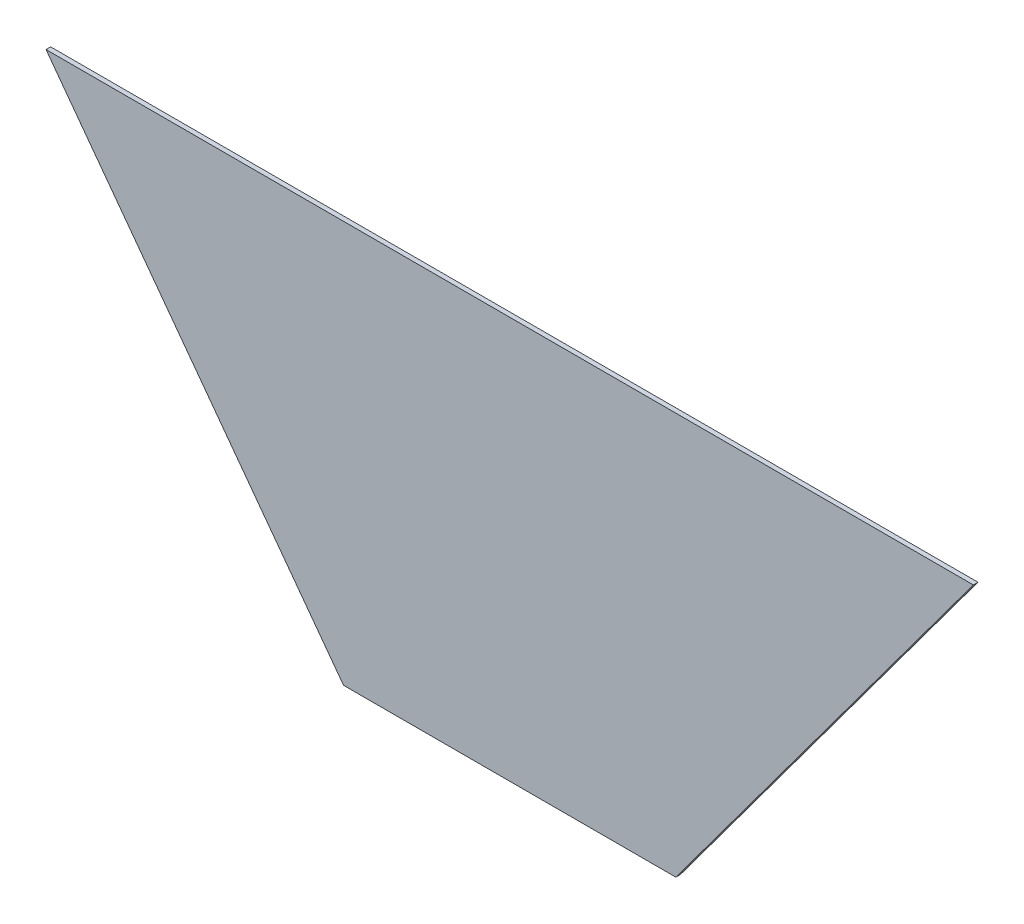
ISO-10303-21;
HEADER;
FILE_DESCRIPTION(('STEP AP214'),'2;1');
FILE_NAME('part.step','',(''),(''),'','','');
FILE_SCHEMA(('AUTOMOTIVE_DESIGN { 1 0 10303 214 1 1 1 1 }'));
ENDSEC;
DATA;
#1=APPLICATION_CONTEXT('core data for automotive mechanical design processes');
#2=APPLICATION_PROTOCOL_DEFINITION('international standard','automotive_design',2000,#1);
#3=PRODUCT_CONTEXT('',#1,'mechanical');
#4=PRODUCT('Part','Part','',(#3));
#5=PRODUCT_RELATED_PRODUCT_CATEGORY('part','',(#4));
#6=PRODUCT_DEFINITION_FORMATION('','',#4);
#7=PRODUCT_DEFINITION_CONTEXT('part definition',#1,'design');
#8=PRODUCT_DEFINITION('design','',#6,#7);
#9=PRODUCT_DEFINITION_SHAPE('','',#8);
#10=(LENGTH_UNIT() NAMED_UNIT(*) SI_UNIT(.MILLI.,.METRE.));
#11=(NAMED_UNIT(*) PLANE_ANGLE_UNIT() SI_UNIT($,.RADIAN.));
#12=(NAMED_UNIT(*) SI_UNIT($,.STERADIAN.) SOLID_ANGLE_UNIT());
#13=UNCERTAINTY_MEASURE_WITH_UNIT(LENGTH_MEASURE(1.E-05),#10,'distance_accuracy_value','');
#14=(GEOMETRIC_REPRESENTATION_CONTEXT(3) GLOBAL_UNCERTAINTY_ASSIGNED_CONTEXT((#13)) GLOBAL_UNIT_ASSIGNED_CONTEXT((#10,
#11,#12)) REPRESENTATION_CONTEXT('',''));
#15=CARTESIAN_POINT('',(0.,0.,0.));
#16=DIRECTION('',(0.,0.,1.));
#17=DIRECTION('',(1.,0.,0.));
#18=AXIS2_PLACEMENT_3D('',#15,#16,#17);
#19=CARTESIAN_POINT('',(-300.,260.,3.));
#20=DIRECTION('',(0.803694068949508,0.595042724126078,0.));
#21=DIRECTION('',(-0.595042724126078,0.803694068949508,0.));
#22=AXIS2_PLACEMENT_3D('',#19,#20,#21);
#23=PLANE('',#22);
#24=DIRECTION('',(0.595042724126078,-0.803694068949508,0.));
#25=VECTOR('',#24,1.);
#26=CARTESIAN_POINT('',(-300.,260.,0.));
#27=LINE('',#26,#25);
#28=CARTESIAN_POINT('',(-300.,260.,0.));
#29=VERTEX_POINT('',#28);
#30=CARTESIAN_POINT('',(-107.5,0.,0.));
#31=VERTEX_POINT('',#30);
#32=EDGE_CURVE('E98',#29,#31,#27,.T.);
#33=ORIENTED_EDGE('',*,*,#32,.T.);
#34=DIRECTION('',(0.,0.,-1.));
#35=VECTOR('',#34,1.);
#36=CARTESIAN_POINT('',(-107.5,0.,3.));
#37=LINE('',#36,#35);
#38=CARTESIAN_POINT('',(-107.5,0.,3.));
#39=VERTEX_POINT('',#38);
#40=EDGE_CURVE('E11',#39,#31,#37,.T.);
#41=ORIENTED_EDGE('',*,*,#40,.F.);
#42=DIRECTION('',(0.595042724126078,-0.803694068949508,0.));
#43=VECTOR('',#42,1.);
#44=CARTESIAN_POINT('',(-300.,260.,3.));
#45=LINE('',#44,#43);
#46=CARTESIAN_POINT('',(-300.,260.,3.));
#47=VERTEX_POINT('',#46);
#48=EDGE_CURVE('E86',#47,#39,#45,.T.);
#49=ORIENTED_EDGE('',*,*,#48,.F.);
#50=DIRECTION('',(0.,0.,-1.));
#51=VECTOR('',#50,1.);
#52=CARTESIAN_POINT('',(-300.,260.,3.));
#53=LINE('',#52,#51);
#54=EDGE_CURVE('E94',#47,#29,#53,.T.);
#55=ORIENTED_EDGE('',*,*,#54,.T.);
#56=EDGE_LOOP('',(#33,#41,#49,#55));
#57=FACE_BOUND('',#56,.T.);
#58=ADVANCED_FACE('F35',(#57),#23,.F.);
#59=CARTESIAN_POINT('',(-107.5,0.,3.));
#60=DIRECTION('',(0.,1.,0.));
#61=DIRECTION('',(0.,0.,1.));
#62=AXIS2_PLACEMENT_3D('',#59,#60,#61);
#63=PLANE('',#62);
#64=DIRECTION('',(1.,0.,0.));
#65=VECTOR('',#64,1.);
#66=CARTESIAN_POINT('',(-107.5,0.,0.));
#67=LINE('',#66,#65);
#68=CARTESIAN_POINT('',(107.5,0.,0.));
#69=VERTEX_POINT('',#68);
#70=EDGE_CURVE('E90',#31,#69,#67,.T.);
#71=ORIENTED_EDGE('',*,*,#70,.T.);
#72=DIRECTION('',(0.,0.,-1.));
#73=VECTOR('',#72,1.);
#74=CARTESIAN_POINT('',(107.5,0.,3.));
#75=LINE('',#74,#73);
#76=CARTESIAN_POINT('',(107.5,0.,3.));
#77=VERTEX_POINT('',#76);
#78=EDGE_CURVE('E43',#77,#69,#75,.T.);
#79=ORIENTED_EDGE('',*,*,#78,.F.);
#80=DIRECTION('',(1.,0.,0.));
#81=VECTOR('',#80,1.);
#82=CARTESIAN_POINT('',(-107.5,0.,3.));
#83=LINE('',#82,#81);
#84=EDGE_CURVE('E81',#39,#77,#83,.T.);
#85=ORIENTED_EDGE('',*,*,#84,.F.);
#86=ORIENTED_EDGE('',*,*,#40,.T.);
#87=EDGE_LOOP('',(#71,#79,#85,#86));
#88=FACE_BOUND('',#87,.T.);
#89=ADVANCED_FACE('F89',(#88),#63,.F.);
#90=CARTESIAN_POINT('',(300.,260.,3.));
#91=DIRECTION('',(-0.803694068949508,0.595042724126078,0.));
#92=DIRECTION('',(-0.595042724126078,-0.803694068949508,0.));
#93=AXIS2_PLACEMENT_3D('',#90,#91,#92);
#94=PLANE('',#93);
#95=DIRECTION('',(0.595042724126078,0.803694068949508,0.));
#96=VECTOR('',#95,1.);
#97=CARTESIAN_POINT('',(300.,260.,0.));
#98=LINE('',#97,#96);
#99=CARTESIAN_POINT('',(300.,260.,0.));
#100=VERTEX_POINT('',#99);
#101=EDGE_CURVE('E68',#69,#100,#98,.T.);
#102=ORIENTED_EDGE('',*,*,#101,.T.);
#103=DIRECTION('',(0.,0.,-1.));
#104=VECTOR('',#103,1.);
#105=CARTESIAN_POINT('',(300.,260.,3.));
#106=LINE('',#105,#104);
#107=CARTESIAN_POINT('',(300.,260.,3.));
#108=VERTEX_POINT('',#107);
#109=EDGE_CURVE('E91',#108,#100,#106,.T.);
#110=ORIENTED_EDGE('',*,*,#109,.F.);
#111=DIRECTION('',(0.595042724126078,0.803694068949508,0.));
#112=VECTOR('',#111,1.);
#113=CARTESIAN_POINT('',(300.,260.,3.));
#114=LINE('',#113,#112);
#115=EDGE_CURVE('E84',#77,#108,#114,.T.);
#116=ORIENTED_EDGE('',*,*,#115,.F.);
#117=ORIENTED_EDGE('',*,*,#78,.T.);
#118=EDGE_LOOP('',(#102,#110,#116,#117));
#119=FACE_BOUND('',#118,.T.);
#120=ADVANCED_FACE('F92',(#119),#94,.F.);
#121=CARTESIAN_POINT('',(-300.,260.,3.));
#122=DIRECTION('',(0.,-1.,0.));
#123=DIRECTION('',(0.,0.,-1.));
#124=AXIS2_PLACEMENT_3D('',#121,#122,#123);
#125=PLANE('',#124);
#126=DIRECTION('',(-1.,0.,0.));
#127=VECTOR('',#126,1.);
#128=CARTESIAN_POINT('',(-300.,260.,0.));
#129=LINE('',#128,#127);
#130=EDGE_CURVE('E74',#100,#29,#129,.T.);
#131=ORIENTED_EDGE('',*,*,#130,.T.);
#132=ORIENTED_EDGE('',*,*,#54,.F.);
#133=DIRECTION('',(-1.,0.,0.));
#134=VECTOR('',#133,1.);
#135=CARTESIAN_POINT('',(-300.,260.,3.));
#136=LINE('',#135,#134);
#137=EDGE_CURVE('E51',#108,#47,#136,.T.);
#138=ORIENTED_EDGE('',*,*,#137,.F.);
#139=ORIENTED_EDGE('',*,*,#109,.T.);
#140=EDGE_LOOP('',(#131,#132,#138,#139));
#141=FACE_BOUND('',#140,.T.);
#142=ADVANCED_FACE('F105',(#141),#125,.F.);
#143=CARTESIAN_POINT('',(0.,0.,3.));
#144=DIRECTION('',(0.,0.,-1.));
#145=DIRECTION('',(-1.,0.,0.));
#146=AXIS2_PLACEMENT_3D('',#143,#144,#145);
#147=PLANE('',#146);
#148=ORIENTED_EDGE('',*,*,#48,.T.);
#149=ORIENTED_EDGE('',*,*,#84,.T.);
#150=ORIENTED_EDGE('',*,*,#115,.T.);
#151=ORIENTED_EDGE('',*,*,#137,.T.);
#152=EDGE_LOOP('',(#148,#149,#150,#151));
#153=FACE_BOUND('',#152,.T.);
#154=ADVANCED_FACE('F82',(#153),#147,.F.);
#155=CARTESIAN_POINT('',(0.,0.,0.));
#156=DIRECTION('',(0.,0.,-1.));
#157=DIRECTION('',(-1.,0.,0.));
#158=AXIS2_PLACEMENT_3D('',#155,#156,#157);
#159=PLANE('',#158);
#160=ORIENTED_EDGE('',*,*,#32,.F.);
#161=ORIENTED_EDGE('',*,*,#130,.F.);
#162=ORIENTED_EDGE('',*,*,#101,.F.);
#163=ORIENTED_EDGE('',*,*,#70,.F.);
#164=EDGE_LOOP('',(#160,#161,#162,#163));
#165=FACE_BOUND('',#164,.T.);
#166=ADVANCED_FACE('F108',(#165),#159,.T.);
#167=CLOSED_SHELL('',(#58,#89,#120,#142,#154,#166));
#168=MANIFOLD_SOLID_BREP('B2',#167);
#169=ADVANCED_BREP_SHAPE_REPRESENTATION('',(#18,#168),#14);
#170=SHAPE_DEFINITION_REPRESENTATION(#9,#169);
ENDSEC;
END-ISO-10303-21;
